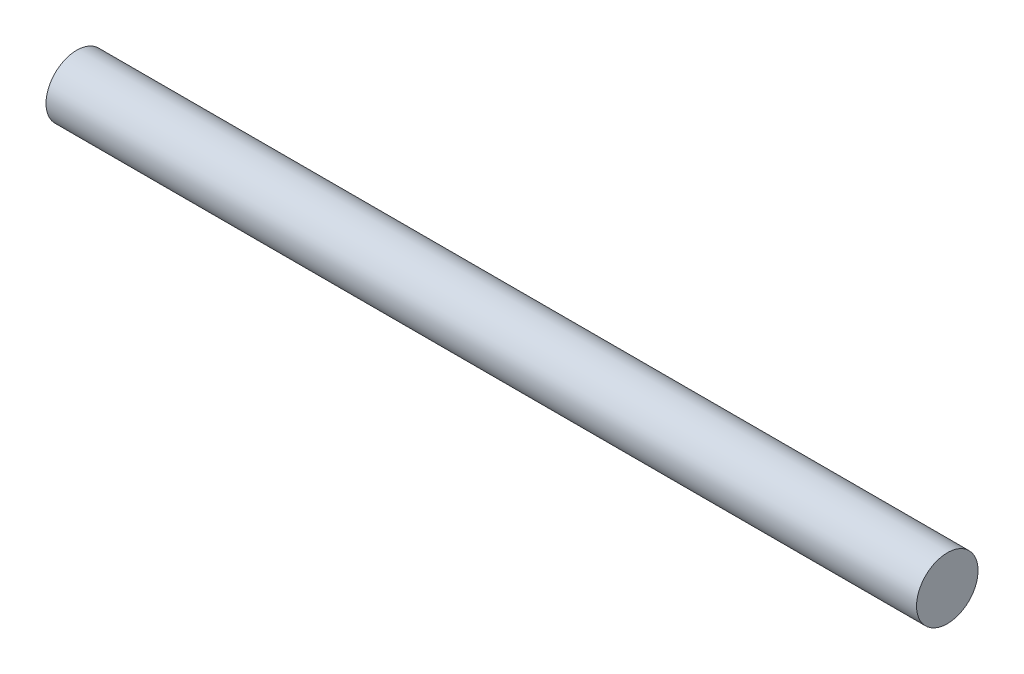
ISO-10303-21;
HEADER;
FILE_DESCRIPTION(('STEP AP214'),'2;1');
FILE_NAME('part.step','',(''),(''),'','','');
FILE_SCHEMA(('AUTOMOTIVE_DESIGN { 1 0 10303 214 1 1 1 1 }'));
ENDSEC;
DATA;
#1=APPLICATION_CONTEXT('core data for automotive mechanical design processes');
#2=APPLICATION_PROTOCOL_DEFINITION('international standard','automotive_design',2000,#1);
#3=PRODUCT_CONTEXT('',#1,'mechanical');
#4=PRODUCT('Part','Part','',(#3));
#5=PRODUCT_RELATED_PRODUCT_CATEGORY('part','',(#4));
#6=PRODUCT_DEFINITION_FORMATION('','',#4);
#7=PRODUCT_DEFINITION_CONTEXT('part definition',#1,'design');
#8=PRODUCT_DEFINITION('design','',#6,#7);
#9=PRODUCT_DEFINITION_SHAPE('','',#8);
#10=(LENGTH_UNIT() NAMED_UNIT(*) SI_UNIT(.MILLI.,.METRE.));
#11=(NAMED_UNIT(*) PLANE_ANGLE_UNIT() SI_UNIT($,.RADIAN.));
#12=(NAMED_UNIT(*) SI_UNIT($,.STERADIAN.) SOLID_ANGLE_UNIT());
#13=UNCERTAINTY_MEASURE_WITH_UNIT(LENGTH_MEASURE(1.E-05),#10,'distance_accuracy_value','');
#14=(GEOMETRIC_REPRESENTATION_CONTEXT(3) GLOBAL_UNCERTAINTY_ASSIGNED_CONTEXT((#13)) GLOBAL_UNIT_ASSIGNED_CONTEXT((#10,
#11,#12)) REPRESENTATION_CONTEXT('',''));
#15=CARTESIAN_POINT('',(0.,0.,0.));
#16=DIRECTION('',(0.,0.,1.));
#17=DIRECTION('',(1.,0.,0.));
#18=AXIS2_PLACEMENT_3D('',#15,#16,#17);
#19=CARTESIAN_POINT('',(-43.2850483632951,4.,0.));
#20=DIRECTION('',(1.,0.,0.));
#21=DIRECTION('',(0.,0.,-1.));
#22=AXIS2_PLACEMENT_3D('',#19,#20,#21);
#23=PLANE('',#22);
#24=CARTESIAN_POINT('',(-43.2850483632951,-1.,0.));
#25=DIRECTION('',(-1.,0.,0.));
#26=DIRECTION('',(0.,0.,1.));
#27=AXIS2_PLACEMENT_3D('',#24,#25,#26);
#28=CIRCLE('',#27,5.);
#29=CARTESIAN_POINT('',(-43.2850483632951,-1.,5.));
#30=VERTEX_POINT('',#29);
#31=EDGE_CURVE('E10',#30,#30,#28,.T.);
#32=ORIENTED_EDGE('',*,*,#31,.T.);
#33=EDGE_LOOP('',(#32));
#34=FACE_BOUND('',#33,.T.);
#35=ADVANCED_FACE('F28',(#34),#23,.F.);
#36=CARTESIAN_POINT('',(-40.,-1.,0.));
#37=DIRECTION('',(-1.,0.,0.));
#38=DIRECTION('',(0.,0.,1.));
#39=AXIS2_PLACEMENT_3D('',#36,#37,#38);
#40=CYLINDRICAL_SURFACE('',#39,5.);
#41=ORIENTED_EDGE('',*,*,#31,.F.);
#42=EDGE_LOOP('',(#41));
#43=FACE_BOUND('',#42,.T.);
#44=CARTESIAN_POINT('',(98.2286724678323,-1.,0.));
#45=DIRECTION('',(-1.,0.,0.));
#46=DIRECTION('',(0.,0.,1.));
#47=AXIS2_PLACEMENT_3D('',#44,#45,#46);
#48=CIRCLE('',#47,5.);
#49=CARTESIAN_POINT('',(98.2286724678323,-1.,5.));
#50=VERTEX_POINT('',#49);
#51=EDGE_CURVE('E34',#50,#50,#48,.T.);
#52=ORIENTED_EDGE('',*,*,#51,.T.);
#53=EDGE_LOOP('',(#52));
#54=FACE_BOUND('',#53,.T.);
#55=ADVANCED_FACE('F40',(#43,#54),#40,.T.);
#56=CARTESIAN_POINT('',(98.2286724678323,4.,0.));
#57=DIRECTION('',(-1.,0.,0.));
#58=DIRECTION('',(0.,0.,1.));
#59=AXIS2_PLACEMENT_3D('',#56,#57,#58);
#60=PLANE('',#59);
#61=ORIENTED_EDGE('',*,*,#51,.F.);
#62=EDGE_LOOP('',(#61));
#63=FACE_BOUND('',#62,.T.);
#64=ADVANCED_FACE('F42',(#63),#60,.F.);
#65=CLOSED_SHELL('',(#35,#55,#64));
#66=MANIFOLD_SOLID_BREP('B2',#65);
#67=ADVANCED_BREP_SHAPE_REPRESENTATION('',(#18,#66),#14);
#68=SHAPE_DEFINITION_REPRESENTATION(#9,#67);
ENDSEC;
END-ISO-10303-21;
